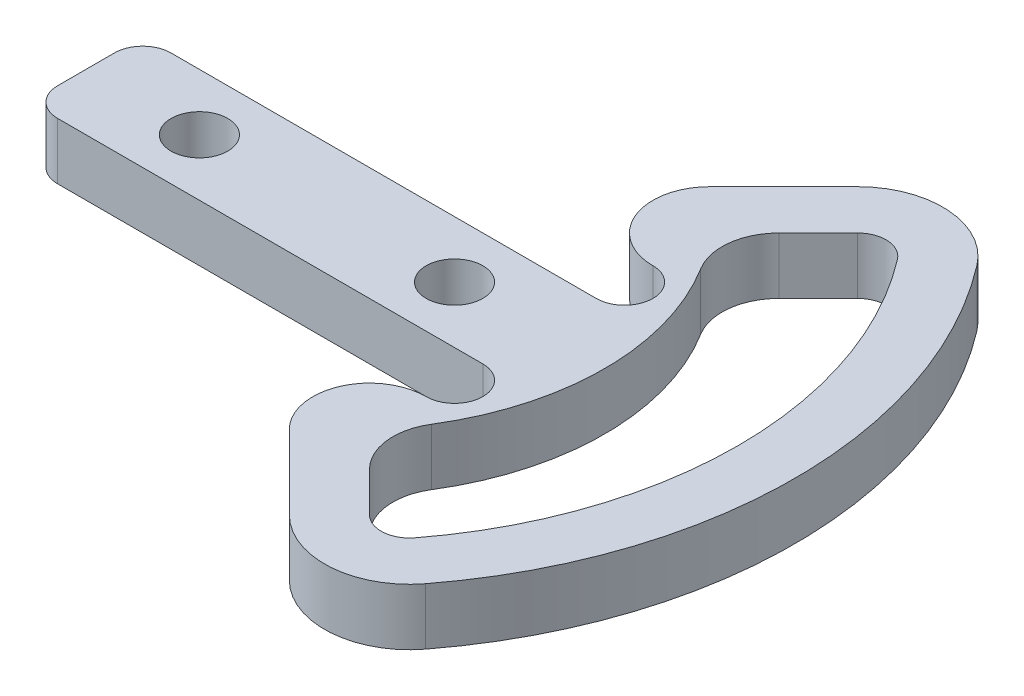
from build123d import *

# Parameters (mm, degrees)
SKETCH1_R      = 5
EXTRUDE1_DEPTH = 5


with BuildPart() as part:
    # Sketch1 → Extrude1 (new, symmetric)
    with BuildSketch(Plane(origin=(0, 0, 0), x_dir=(1, 0, 0), z_dir=(0, 1, 0))):
        with BuildLine():
            Line((0, -5), (0, 5))
            ThreePointArc((0, 5), (1.464466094, 8.535533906), (5, 10))
            Line((5, 10), (80, 10))
            ThreePointArc((80, 10), (85, 15), (80, 20))
            ThreePointArc((80, 20), (70.761204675, 26.173165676), (72.928932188, 37.071067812))
            Line((72.928932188, 37.071067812), (85.99286892, 50.135004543))
            ThreePointArc((85.99286892, 50.135004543), (97.586478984, 54.495894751), (108.507040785, 48.650341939))
            ThreePointArc((108.507040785, 48.650341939), (125, 0), (108.507040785, -48.650341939))
            ThreePointArc((108.507040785, -48.650341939), (97.586478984, -54.495894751), (85.99286892, -50.135004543))
            Line((85.99286892, -50.135004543), (72.928932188, -37.071067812))
            ThreePointArc((72.928932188, -37.071067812), (70.761204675, -26.173165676), (80, -20))
            ThreePointArc((80, -20), (85, -15), (80, -10))
            Line((80, -10), (5, -10))
            ThreePointArc((5, -10), (1.464466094, -8.535533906), (0, -5))
        make_face()
        with Locations(Location((20, 0, 0), (0, 0, 270))):
            Circle(SKETCH1_R, mode=Mode.SUBTRACT)
        with Locations(Location((65, 0, 0), (0, 0, 270))):
            Circle(SKETCH1_R, mode=Mode.SUBTRACT)
        with BuildLine():
            Line((86.10199345, 36.10199345), (93.063936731, 43.063936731))
            ThreePointArc((93.063936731, 43.063936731), (96.92847342, 44.517566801), (100.568660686, 42.569049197))
            ThreePointArc((100.568660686, 42.569049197), (115, 0), (100.568660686, -42.569049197))
            ThreePointArc((100.568660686, -42.569049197), (96.92847342, -44.517566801), (93.063936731, -43.063936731))
            Line((93.063936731, -43.063936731), (86.10199345, -36.10199345))
            ThreePointArc((86.10199345, -36.10199345), (83.238740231, -30.175157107), (84.679592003, -23.752575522))
            ThreePointArc((84.679592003, -23.752575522), (91.458980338, 0), (84.679592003, 23.752575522))
            ThreePointArc((84.679592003, 23.752575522), (83.238740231, 30.175157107), (86.10199345, 36.10199345))
        make_face(mode=Mode.SUBTRACT)
    extrude(amount=EXTRUDE1_DEPTH, both=True)


solid = part.part
